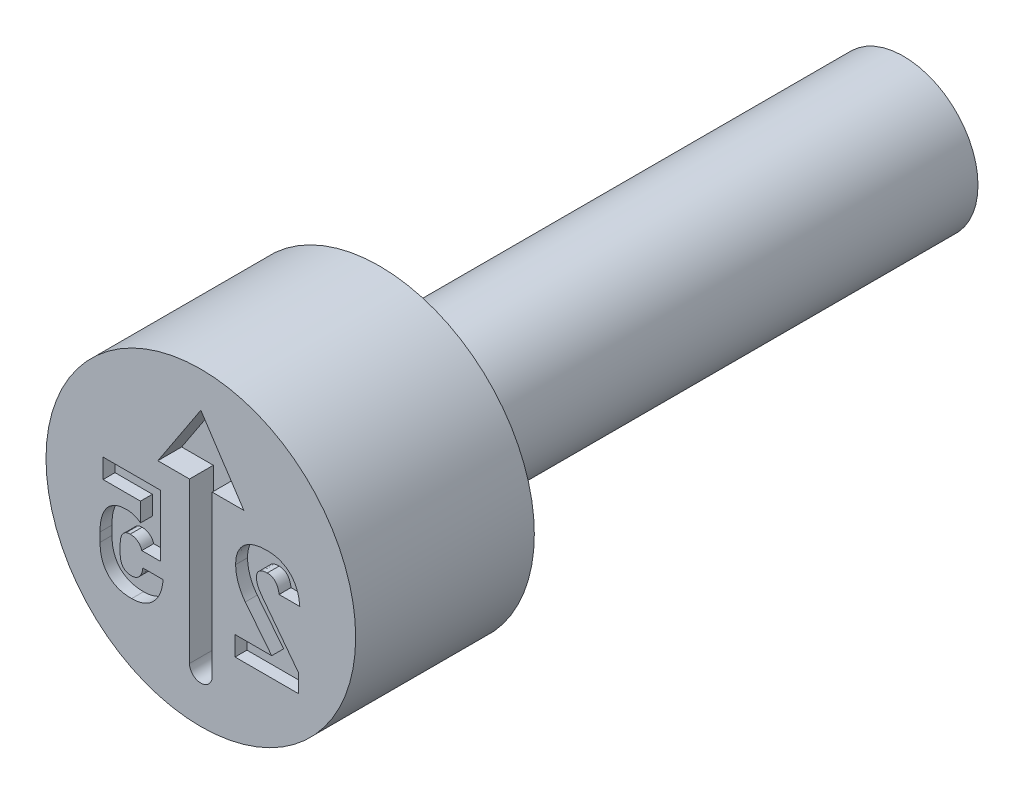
from build123d import *

# Parameters (mm, degrees)
CUT_EXTRUDE4_DEPTH = 0.4
CUT_EXTRUDE5_DEPTH = 0.2


with BuildPart() as part:
    # Sketch2 → Revolve1 (revolve)
    with BuildSketch(Plane(origin=(0, 0, 0), x_dir=(0, 0, -1), z_dir=(1, 0, 0)), mode=Mode.PRIVATE) as revolve1_sk:
        Polygon((0, 2.6), (0, 0), (11.8, 0), (11.8, 1.25), (3, 1.25), (3, 2.6), align=None)
    revolve(revolve1_sk.sketch.rotate(Axis((0, 0, -0.403888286), (0, 0, -1)), 90), axis=Axis((0, 0, -0.403888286), (0, 0, -1)))

    # Sketch3 → Cut-Extrude4 (cut)
    with BuildSketch(Plane.XY):
        with BuildLine():
            Line((0.190473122, 0.906351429), (0.190473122, -1.776161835))
            ThreePointArc((0.190473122, -1.776161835), (0, -1.966634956), (-0.190473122, -1.776161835))
            Line((-0.190473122, -1.776161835), (-0.190473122, 0.906351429))
            Line((-0.190473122, 0.906351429), (-0.721917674, 0.906351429))
            Line((-0.721917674, 0.906351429), (0, 2.002115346))
            Line((0, 2.002115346), (0.721917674, 0.906351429))
            Line((0.721917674, 0.906351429), (0.190473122, 0.906351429))
        make_face()
    extrude(amount=-CUT_EXTRUDE4_DEPTH, mode=Mode.SUBTRACT)

    # Sketch4 → Cut-Extrude5 (cut)
    with BuildSketch(Plane.XY):
        with BuildLine():
            Line((1.639106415, -0.994069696), (1.021376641, -0.181923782))
            add(Edge.make_bspline(
                [(1.021376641, -0.181923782), (1.008421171, -0.163949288), (0.983129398, -0.128859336), (0.960501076, -0.080460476), (0.946126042, -0.042510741), (0.939480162, -0.014982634), (0.934560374, 0.011340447), (0.933986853, 0.028611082), (0.933705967, 0.037069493)],
                knots=[0, 0, 0, 0, 1.660423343, 3.241491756, 3.993801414, 4.704207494, 5.365376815, 6, 6, 6, 6], degree=3))
            Line((0.933705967, 0.037069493), (0.933705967, 0.039637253))
            add(Edge.make_bspline(
                [(0.933705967, 0.039637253), (0.934198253, 0.051195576), (0.935136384, 0.073221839), (0.944193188, 0.104210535), (0.959169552, 0.131007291), (0.980147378, 0.153470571), (1.006831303, 0.17073464), (1.038306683, 0.18334591), (1.074740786, 0.19048152), (1.10057882, 0.191390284), (1.114182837, 0.191868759)],
                knots=[0, 0, 0, 0, 1.033361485, 1.969238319, 2.861873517, 3.760870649, 4.693536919, 5.686153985, 6.781734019, 8, 8, 8, 8], degree=3))
            add(Edge.make_bspline(
                [(1.114182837, 0.191868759), (1.127578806, 0.191302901), (1.153576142, 0.19020475), (1.190557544, 0.179740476), (1.223409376, 0.161975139), (1.251847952, 0.137423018), (1.275710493, 0.106536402), (1.293298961, 0.069328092), (1.307463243, 0.02703926), (1.311573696, -0.0036534), (1.313734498, -0.019788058)],
                knots=[0, 0, 0, 0, 0.993701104, 1.928459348, 2.826878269, 3.748294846, 4.700551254, 5.70417143, 6.793118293, 8, 8, 8, 8], degree=3))
            Line((1.313734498, -0.019788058), (1.313734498, -0.02125535))
            Line((1.313734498, -0.02125535), (1.661482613, -0.02125535))
            Line((1.661482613, -0.02125535), (1.661482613, -0.019788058))
            add(Edge.make_bspline(
                [(1.661482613, -0.019788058), (1.65899096, 0.007310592), (1.654137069, 0.060100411), (1.637632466, 0.136016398), (1.61325038, 0.205870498), (1.582098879, 0.269855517), (1.543901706, 0.327163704), (1.499581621, 0.377779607), (1.448647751, 0.420720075), (1.391982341, 0.456401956), (1.329832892, 0.484326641), (1.262959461, 0.504672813), (1.19126133, 0.516402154), (1.141981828, 0.517927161), (1.116750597, 0.518707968)],
                knots=[0, 0, 0, 0, 1.143950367, 2.228484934, 3.258162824, 4.249580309, 5.213917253, 6.146796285, 7.070112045, 8.006232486, 8.954636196, 9.927630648, 10.9389416, 12, 12, 12, 12], degree=3))
            add(Edge.make_bspline(
                [(1.116750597, 0.518707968), (1.089694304, 0.51814235), (1.037328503, 0.517047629), (0.961925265, 0.506742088), (0.892590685, 0.489592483), (0.829498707, 0.465497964), (0.773063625, 0.434525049), (0.723024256, 0.397760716), (0.680793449, 0.35377777), (0.645665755, 0.303812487), (0.617974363, 0.248057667), (0.598582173, 0.186561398), (0.58670627, 0.119817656), (0.58524392, 0.073435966), (0.58449056, 0.049541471)],
                knots=[0, 0, 0, 0, 1.208591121, 2.339154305, 3.392741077, 4.394302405, 5.348037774, 6.261656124, 7.158186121, 8.060194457, 8.981460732, 9.928425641, 10.932785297, 12, 12, 12, 12], degree=3))
            Line((0.58449056, 0.049541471), (0.58449056, 0.04807418))
            add(Edge.make_bspline(
                [(0.58449056, 0.04807418), (0.584960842, 0.027628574), (0.585902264, -0.013299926), (0.594298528, -0.074445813), (0.608027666, -0.135238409), (0.626656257, -0.195464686), (0.64991821, -0.25411899), (0.677679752, -0.310266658), (0.709375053, -0.363764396), (0.734210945, -0.396849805), (0.746626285, -0.413389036)],
                knots=[0, 0, 0, 0, 0.985191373, 1.972179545, 2.968870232, 3.986806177, 5.007996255, 6.007036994, 7.003727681, 8, 8, 8, 8], degree=3))
            Line((0.746626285, -0.413389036), (1.189748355, -0.973160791))
            Line((1.189748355, -0.973160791), (0.574586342, -0.973160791))
            Line((0.574586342, -0.973160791), (0.574586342, -1.3))
            Line((0.574586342, -1.3), (1.639106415, -1.3))
            Line((1.639106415, -1.3), (1.639106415, -0.994069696))
        make_face()
        with BuildLine():
            add(Edge.make_bspline(
                [(-1.162246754, -1.318707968), (-1.138589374, -1.317986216), (-1.092295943, -1.316573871), (-1.024816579, -1.3038949), (-0.960843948, -1.284259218), (-0.90085375, -1.25624758), (-0.845497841, -1.220659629), (-0.796000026, -1.177141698), (-0.751906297, -1.126833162), (-0.714100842, -1.069293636), (-0.682966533, -1.005138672), (-0.658727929, -0.935124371), (-0.642079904, -0.859376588), (-0.637240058, -0.806824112), (-0.634755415, -0.779845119)],
                knots=[0, 0, 0, 0, 1.013165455, 1.982590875, 2.932437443, 3.87502652, 4.811241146, 5.743574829, 6.690699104, 7.67044025, 8.68537997, 9.739549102, 10.839546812, 12, 12, 12, 12], degree=3))
            Line((-0.634755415, -0.779845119), (-0.634755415, -0.77874465))
            Line((-0.634755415, -0.77874465), (-0.974066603, -0.77874465))
            Line((-0.974066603, -0.77874465), (-0.974066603, -0.779845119))
            add(Edge.make_bspline(
                [(-0.974066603, -0.779845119), (-0.976003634, -0.795599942), (-0.979695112, -0.825624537), (-0.993006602, -0.867290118), (-1.010385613, -0.903913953), (-1.033341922, -0.934644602), (-1.060602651, -0.95959351), (-1.092905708, -0.976514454), (-1.128607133, -0.987805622), (-1.153963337, -0.988792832), (-1.167015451, -0.989300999)],
                knots=[0, 0, 0, 0, 1.202223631, 2.291125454, 3.30376979, 4.265156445, 5.185306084, 6.082185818, 7.012804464, 8, 8, 8, 8], degree=3))
            add(Edge.make_bspline(
                [(-1.167015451, -0.989300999), (-1.181162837, -0.988684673), (-1.208223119, -0.987505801), (-1.246152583, -0.976127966), (-1.279171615, -0.957911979), (-1.306445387, -0.931700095), (-1.328202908, -0.899040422), (-1.343604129, -0.85993036), (-1.352725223, -0.81499059), (-1.353622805, -0.783070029), (-1.354095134, -0.766272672)],
                knots=[0, 0, 0, 0, 1.026088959, 1.96264217, 2.850204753, 3.743092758, 4.68486217, 5.681854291, 6.780136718, 8, 8, 8, 8], degree=3))
            Line((-1.354095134, -0.766272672), (-1.354095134, -0.615508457))
            add(Edge.make_bspline(
                [(-1.354095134, -0.615508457), (-1.353732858, -0.598712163), (-1.353045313, -0.566835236), (-1.344492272, -0.522244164), (-1.331193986, -0.483339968), (-1.311554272, -0.451044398), (-1.287140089, -0.424976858), (-1.257595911, -0.406462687), (-1.223515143, -0.395527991), (-1.199378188, -0.39424692), (-1.186823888, -0.393580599)],
                knots=[0, 0, 0, 0, 1.281587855, 2.432267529, 3.454745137, 4.406485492, 5.298532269, 6.159104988, 7.042499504, 8, 8, 8, 8], degree=3))
            add(Edge.make_bspline(
                [(-1.186823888, -0.393580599), (-1.175047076, -0.393939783), (-1.152247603, -0.39463515), (-1.119419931, -0.401835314), (-1.089248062, -0.413615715), (-1.062074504, -0.430271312), (-1.038074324, -0.450684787), (-1.018314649, -0.475350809), (-1.001750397, -0.50322205), (-0.994838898, -0.524125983), (-0.991307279, -0.534807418)],
                knots=[0, 0, 0, 0, 1.085085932, 2.100686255, 3.083167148, 4.060192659, 5.028057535, 5.974180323, 6.964852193, 8, 8, 8, 8], degree=3))
            Line((-0.991307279, -0.534807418), (-0.674372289, -0.534807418))
            Line((-0.674372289, -0.534807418), (-0.674372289, 0.5))
            Line((-0.674372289, 0.5), (-1.641317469, 0.5))
            Line((-1.641317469, 0.5), (-1.641317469, 0.173160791))
            Line((-1.641317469, 0.173160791), (-1.013683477, 0.173160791))
            Line((-1.013683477, 0.173160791), (-1.013683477, -0.144874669))
            add(Edge.make_bspline(
                [(-1.013683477, -0.144874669), (-1.020512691, -0.138827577), (-1.034560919, -0.126388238), (-1.059121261, -0.110593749), (-1.087210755, -0.097178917), (-1.12865941, -0.081728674), (-1.183183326, -0.067989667), (-1.227943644, -0.065676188), (-1.249917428, -0.064540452)],
                knots=[0, 0, 0, 0, 0.643749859, 1.324243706, 2.054464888, 2.839075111, 4.448235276, 6, 6, 6, 6], degree=3))
            add(Edge.make_bspline(
                [(-1.249917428, -0.064540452), (-1.272476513, -0.06525468), (-1.316229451, -0.066639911), (-1.379339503, -0.07910039), (-1.437501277, -0.099063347), (-1.490234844, -0.127824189), (-1.537599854, -0.163871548), (-1.578739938, -0.207918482), (-1.61391156, -0.25924703), (-1.642696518, -0.317891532), (-1.665351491, -0.383338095), (-1.681806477, -0.455129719), (-1.691183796, -0.533336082), (-1.692406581, -0.587482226), (-1.693039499, -0.615508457)],
                knots=[0, 0, 0, 0, 1.012739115, 1.964189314, 2.878178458, 3.765675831, 4.65138573, 5.541464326, 6.461953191, 7.437418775, 8.467828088, 9.567356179, 10.740855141, 12, 12, 12, 12], degree=3))
            Line((-1.693039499, -0.615508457), (-1.693039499, -0.766272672))
            add(Edge.make_bspline(
                [(-1.693039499, -0.766272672), (-1.692235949, -0.794307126), (-1.690681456, -0.848540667), (-1.6795652, -0.926966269), (-1.659525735, -0.998905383), (-1.632675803, -1.064823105), (-1.597615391, -1.123409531), (-1.555632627, -1.175159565), (-1.505961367, -1.218878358), (-1.449773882, -1.255671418), (-1.386535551, -1.283889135), (-1.317256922, -1.304388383), (-1.241663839, -1.316581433), (-1.189315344, -1.317983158), (-1.162246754, -1.318707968)],
                knots=[0, 0, 0, 0, 1.159103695, 2.242322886, 3.265299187, 4.239894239, 5.17631577, 6.078070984, 6.98412447, 7.901225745, 8.844758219, 9.836512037, 10.881294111, 12, 12, 12, 12], degree=3))
        make_face()
    extrude(amount=-CUT_EXTRUDE5_DEPTH, mode=Mode.SUBTRACT)


solid = part.part
